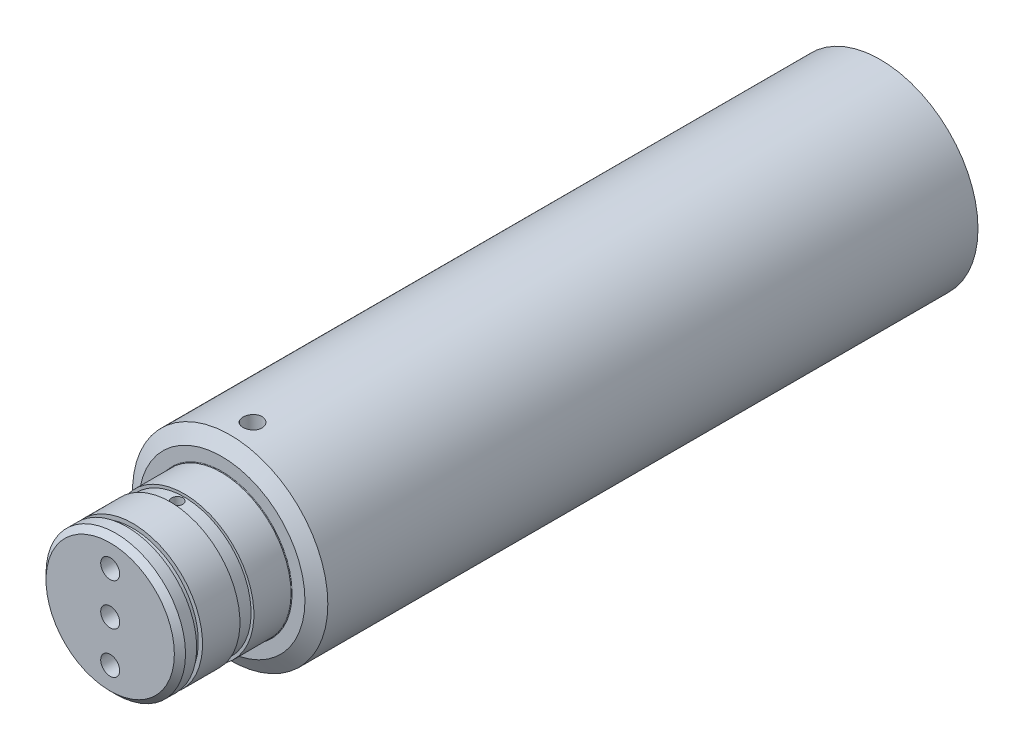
ISO-10303-21;
HEADER;
FILE_DESCRIPTION(('STEP AP214'),'2;1');
FILE_NAME('part.step','',(''),(''),'','','');
FILE_SCHEMA(('AUTOMOTIVE_DESIGN { 1 0 10303 214 1 1 1 1 }'));
ENDSEC;
DATA;
#1=APPLICATION_CONTEXT('core data for automotive mechanical design processes');
#2=APPLICATION_PROTOCOL_DEFINITION('international standard','automotive_design',2000,#1);
#3=PRODUCT_CONTEXT('',#1,'mechanical');
#4=PRODUCT('Part','Part','',(#3));
#5=PRODUCT_RELATED_PRODUCT_CATEGORY('part','',(#4));
#6=PRODUCT_DEFINITION_FORMATION('','',#4);
#7=PRODUCT_DEFINITION_CONTEXT('part definition',#1,'design');
#8=PRODUCT_DEFINITION('design','',#6,#7);
#9=PRODUCT_DEFINITION_SHAPE('','',#8);
#10=(LENGTH_UNIT() NAMED_UNIT(*) SI_UNIT(.MILLI.,.METRE.));
#11=(NAMED_UNIT(*) PLANE_ANGLE_UNIT() SI_UNIT($,.RADIAN.));
#12=(NAMED_UNIT(*) SI_UNIT($,.STERADIAN.) SOLID_ANGLE_UNIT());
#13=UNCERTAINTY_MEASURE_WITH_UNIT(LENGTH_MEASURE(1.E-05),#10,'distance_accuracy_value','');
#14=(GEOMETRIC_REPRESENTATION_CONTEXT(3) GLOBAL_UNCERTAINTY_ASSIGNED_CONTEXT((#13)) GLOBAL_UNIT_ASSIGNED_CONTEXT((#10,
#11,#12)) REPRESENTATION_CONTEXT('',''));
#15=CARTESIAN_POINT('',(0.,0.,0.));
#16=DIRECTION('',(0.,0.,1.));
#17=DIRECTION('',(1.,0.,0.));
#18=AXIS2_PLACEMENT_3D('',#15,#16,#17);
#19=CARTESIAN_POINT('',(0.,8.88178419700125E-13,187.852900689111));
#20=DIRECTION('',(0.,0.,-1.));
#21=DIRECTION('',(-1.00000000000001,0.,0.));
#22=AXIS2_PLACEMENT_3D('',#19,#20,#21);
#23=CYLINDRICAL_SURFACE('',#22,25.);
#24=CARTESIAN_POINT('',(0.,8.88178419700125E-13,270.000000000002));
#25=DIRECTION('',(0.,0.,-1.));
#26=DIRECTION('',(-1.00000000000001,0.,0.));
#27=AXIS2_PLACEMENT_3D('',#24,#25,#26);
#28=CIRCLE('',#27,25.);
#29=CARTESIAN_POINT('',(-25.0000000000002,8.64586180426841E-13,270.000000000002));
#30=VERTEX_POINT('',#29);
#31=EDGE_CURVE('E2052',#30,#30,#28,.T.);
#32=ORIENTED_EDGE('',*,*,#31,.F.);
#33=EDGE_LOOP('',(#32));
#34=FACE_BOUND('',#33,.T.);
#35=CARTESIAN_POINT('',(-2.22044604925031E-13,8.88178419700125E-13,274.000000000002));
#36=DIRECTION('',(0.,0.,1.));
#37=DIRECTION('',(1.00000000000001,0.,0.));
#38=AXIS2_PLACEMENT_3D('',#35,#36,#37);
#39=CIRCLE('',#38,25.);
#40=CARTESIAN_POINT('',(24.9999999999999,9.1177065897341E-13,274.000000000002));
#41=VERTEX_POINT('',#40);
#42=EDGE_CURVE('E2172',#41,#41,#39,.F.);
#43=ORIENTED_EDGE('',*,*,#42,.T.);
#44=EDGE_LOOP('',(#43));
#45=FACE_BOUND('',#44,.T.);
#46=ADVANCED_FACE('F2014',(#34,#45),#23,.T.);
#47=CARTESIAN_POINT('',(-4.44089209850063E-13,4.44089209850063E-13,236.000000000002));
#48=DIRECTION('',(0.,0.,-1.));
#49=DIRECTION('',(-1.00000000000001,0.,0.));
#50=AXIS2_PLACEMENT_3D('',#47,#48,#49);
#51=CYLINDRICAL_SURFACE('',#50,35.);
#52=CARTESIAN_POINT('',(1.33226762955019E-12,35.000000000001,228.400000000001));
#53=CARTESIAN_POINT('',(-0.19049784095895,34.9999978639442,228.399991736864));
#54=CARTESIAN_POINT('',(-0.381122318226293,34.9984282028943,228.383936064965));
#55=CARTESIAN_POINT('',(-0.757088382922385,34.992317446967,228.320128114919));
#56=CARTESIAN_POINT('',(-0.94242388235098,34.9877730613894,228.272340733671));
#57=CARTESIAN_POINT('',(-1.30231305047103,34.9762259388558,228.146471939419));
#58=CARTESIAN_POINT('',(-1.47687308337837,34.9692246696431,228.068408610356));
#59=CARTESIAN_POINT('',(-1.81037391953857,34.9535470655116,227.884238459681));
#60=CARTESIAN_POINT('',(-1.96931786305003,34.9448710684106,227.778137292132));
#61=CARTESIAN_POINT('',(-2.26765473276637,34.9267831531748,227.540515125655));
#62=CARTESIAN_POINT('',(-2.40698703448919,34.9173690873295,227.408918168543));
#63=CARTESIAN_POINT('',(-2.66162457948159,34.8988838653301,227.124201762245));
#64=CARTESIAN_POINT('',(-2.77692872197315,34.8898127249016,226.971081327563));
#65=CARTESIAN_POINT('',(-2.98045002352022,34.8730182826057,226.647287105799));
#66=CARTESIAN_POINT('',(-3.06861258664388,34.8652977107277,226.476578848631));
#67=CARTESIAN_POINT('',(-3.21499948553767,34.8521048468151,226.122693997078));
#68=CARTESIAN_POINT('',(-3.27322452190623,34.8466325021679,225.939517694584));
#69=CARTESIAN_POINT('',(-3.35790448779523,34.8385748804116,225.566512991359));
#70=CARTESIAN_POINT('',(-3.38445967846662,34.8359804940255,225.376707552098));
#71=CARTESIAN_POINT('',(-3.40535603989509,34.8339441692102,224.995317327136));
#72=CARTESIAN_POINT('',(-3.39969801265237,34.8345021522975,224.803732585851));
#73=CARTESIAN_POINT('',(-3.35641122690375,34.8386992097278,224.424912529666));
#74=CARTESIAN_POINT('',(-3.31889184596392,34.8423277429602,224.237664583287));
#75=CARTESIAN_POINT('',(-3.21311753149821,34.8522405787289,223.872136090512));
#76=CARTESIAN_POINT('',(-3.14486220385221,34.85852491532,223.693855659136));
#77=CARTESIAN_POINT('',(-2.97943246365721,34.8730534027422,223.350976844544));
#78=CARTESIAN_POINT('',(-2.88220942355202,34.8813008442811,223.186402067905));
#79=CARTESIAN_POINT('',(-2.66163902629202,34.8988234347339,222.875864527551));
#80=CARTESIAN_POINT('',(-2.53829094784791,34.9080986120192,222.729902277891));
#81=CARTESIAN_POINT('',(-2.26836049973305,34.9266785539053,222.460097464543));
#82=CARTESIAN_POINT('',(-2.12168365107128,34.9359832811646,222.336349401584));
#83=CARTESIAN_POINT('',(-1.80958763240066,34.9535374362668,222.115217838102));
#84=CARTESIAN_POINT('',(-1.64416844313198,34.9617868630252,222.01783436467));
#85=CARTESIAN_POINT('',(-1.29921865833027,34.9763034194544,221.852200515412));
#86=CARTESIAN_POINT('',(-1.11968580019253,34.9825702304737,221.783954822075));
#87=CARTESIAN_POINT('',(-0.751635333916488,34.9924121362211,221.67860246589));
#88=CARTESIAN_POINT('',(-0.563117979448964,34.995987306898,221.64149492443));
#89=CARTESIAN_POINT('',(-0.183268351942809,35.0000333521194,221.599591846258));
#90=CARTESIAN_POINT('',(0.00804940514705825,35.0005167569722,221.594665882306));
#91=CARTESIAN_POINT('',(0.388787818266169,34.9983583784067,221.616923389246));
#92=CARTESIAN_POINT('',(0.578208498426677,34.995716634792,221.644106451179));
#93=CARTESIAN_POINT('',(0.94940018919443,34.9876128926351,221.729702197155));
#94=CARTESIAN_POINT('',(1.13118538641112,34.9821563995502,221.788053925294));
#95=CARTESIAN_POINT('',(1.48238659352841,34.9690354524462,221.934268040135));
#96=CARTESIAN_POINT('',(1.65180234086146,34.9613709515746,222.022131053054));
#97=CARTESIAN_POINT('',(1.97404597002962,34.9446604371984,222.225197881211));
#98=CARTESIAN_POINT('',(2.12681954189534,34.9356101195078,222.34048752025));
#99=CARTESIAN_POINT('',(2.41089266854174,34.9171576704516,222.595011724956));
#100=CARTESIAN_POINT('',(2.54219171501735,34.9077555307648,222.734246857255));
#101=CARTESIAN_POINT('',(2.78004054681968,34.8896215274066,223.03327819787));
#102=CARTESIAN_POINT('',(2.88650482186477,34.8808920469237,223.193142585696));
#103=CARTESIAN_POINT('',(3.07107442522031,34.8651275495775,223.528557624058));
#104=CARTESIAN_POINT('',(3.14918012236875,34.8580925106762,223.704108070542));
#105=CARTESIAN_POINT('',(3.27467182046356,34.8465280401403,224.065616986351));
#106=CARTESIAN_POINT('',(3.32210896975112,34.8419944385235,224.251557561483));
#107=CARTESIAN_POINT('',(3.38508307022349,34.8359330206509,224.628810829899));
#108=CARTESIAN_POINT('',(3.40062088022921,34.834405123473,224.820123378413));
#109=CARTESIAN_POINT('',(3.39934369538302,34.834529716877,225.201840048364));
#110=CARTESIAN_POINT('',(3.38266303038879,34.8361690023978,225.392244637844));
#111=CARTESIAN_POINT('',(3.31770376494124,34.8424151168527,225.767533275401));
#112=CARTESIAN_POINT('',(3.26942512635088,34.8470219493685,225.952417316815));
#113=CARTESIAN_POINT('',(3.14267688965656,34.8586804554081,226.311417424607));
#114=CARTESIAN_POINT('',(3.06421096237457,34.8657318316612,226.485534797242));
#115=CARTESIAN_POINT('',(2.87932953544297,34.8814855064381,226.818148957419));
#116=CARTESIAN_POINT('',(2.77291424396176,34.8901877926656,226.976645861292));
#117=CARTESIAN_POINT('',(2.53465010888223,34.9083061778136,227.274208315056));
#118=CARTESIAN_POINT('',(2.40270124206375,34.9177249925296,227.413193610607));
#119=CARTESIAN_POINT('',(2.11731119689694,34.9361903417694,227.667110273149));
#120=CARTESIAN_POINT('',(1.96386486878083,34.9452367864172,227.782035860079));
#121=CARTESIAN_POINT('',(1.63943695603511,34.9619603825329,227.984784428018));
#122=CARTESIAN_POINT('',(1.46841425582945,34.9696342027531,228.072541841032));
#123=CARTESIAN_POINT('',(1.11409669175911,34.9827112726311,228.217977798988));
#124=CARTESIAN_POINT('',(0.930815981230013,34.9881170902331,228.275690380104));
#125=CARTESIAN_POINT('',(0.622074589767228,34.9946853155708,228.344950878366));
#126=CARTESIAN_POINT('',(0.498589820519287,34.9966690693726,228.365566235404));
#127=CARTESIAN_POINT('',(0.250088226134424,34.999327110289,228.393093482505));
#128=CARTESIAN_POINT('',(0.125071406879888,35.0000014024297,228.400005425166));
#129=CARTESIAN_POINT('',(1.33226762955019E-12,35.000000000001,228.400000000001));
#130=B_SPLINE_CURVE_WITH_KNOTS('',3,(#52,#53,#54,#55,#56,#57,#58,#59,#60,#61,#62,#63,#64,#65,
#66,#67,#68,#69,#70,#71,#72,#73,#74,#75,#76,#77,#78,#79,#80,#81,#82,#83,#84,#85,#86,#87,#88,#89,
#90,#91,#92,#93,#94,#95,#96,#97,#98,#99,#100,#101,#102,#103,#104,#105,#106,#107,#108,#109,#110,
#111,#112,#113,#114,#115,#116,#117,#118,#119,#120,#121,#122,#123,#124,#125,#126,#127,#128,#129),
.UNSPECIFIED.,.T.,.F.,(4,2,2,2,2,2,2,2,2,2,2,2,2,2,2,2,2,2,2,2,2,2,2,2,2,2,2,2,2,2,2,2,2,2,2,2,
2,2,4),(0.,0.571036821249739,1.14270640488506,1.71403505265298,2.2852485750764,2.8581908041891,
3.43115927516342,4.00527286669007,4.57937302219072,5.15165081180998,5.72391435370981,
6.29422126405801,6.86453548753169,7.43581253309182,8.00710535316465,8.58077369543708,
9.1544426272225,9.72820371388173,10.3019486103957,10.873366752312,11.4447776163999,
12.0150750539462,12.5853845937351,13.1575027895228,13.7296345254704,14.3037080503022,
14.8777741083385,15.4508802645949,16.0239709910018,16.5946774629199,17.165384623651,
17.7360224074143,18.3066559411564,18.8795718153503,19.4526251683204,20.0270509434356,
20.6008245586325,20.975740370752,21.3506547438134),.UNSPECIFIED.);
#131=CARTESIAN_POINT('',(1.33226762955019E-12,35.000000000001,228.400000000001));
#132=VERTEX_POINT('',#131);
#133=EDGE_CURVE('E2211',#132,#132,#130,.T.);
#134=ORIENTED_EDGE('',*,*,#133,.T.);
#135=EDGE_LOOP('',(#134));
#136=FACE_BOUND('',#135,.T.);
#137=CARTESIAN_POINT('',(-2.22044604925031E-13,8.88178419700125E-13,233.000000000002));
#138=DIRECTION('',(0.,0.,1.));
#139=DIRECTION('',(1.00000000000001,0.,0.));
#140=AXIS2_PLACEMENT_3D('',#137,#138,#139);
#141=CIRCLE('',#140,35.);
#142=CARTESIAN_POINT('',(35.,9.21207554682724E-13,233.000000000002));
#143=VERTEX_POINT('',#142);
#144=EDGE_CURVE('E2169',#143,#143,#141,.F.);
#145=ORIENTED_EDGE('',*,*,#144,.T.);
#146=EDGE_LOOP('',(#145));
#147=FACE_BOUND('',#146,.T.);
#148=CARTESIAN_POINT('',(0.,0.,0.));
#149=DIRECTION('',(0.,0.,1.));
#150=DIRECTION('',(1.00000000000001,0.,0.));
#151=AXIS2_PLACEMENT_3D('',#148,#149,#150);
#152=CIRCLE('',#151,35.);
#153=CARTESIAN_POINT('',(35.0000000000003,0.,0.));
#154=VERTEX_POINT('',#153);
#155=EDGE_CURVE('E2163',#154,#154,#152,.T.);
#156=ORIENTED_EDGE('',*,*,#155,.T.);
#157=EDGE_LOOP('',(#156));
#158=FACE_BOUND('',#157,.T.);
#159=ADVANCED_FACE('F2115',(#136,#147,#158),#51,.T.);
#160=CARTESIAN_POINT('',(-4.44089209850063E-13,4.44089209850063E-13,236.000000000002));
#161=DIRECTION('',(0.,0.,1.));
#162=DIRECTION('',(1.00000000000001,0.,0.));
#163=AXIS2_PLACEMENT_3D('',#160,#161,#162);
#164=PLANE('',#163);
#165=CARTESIAN_POINT('',(-4.44089209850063E-13,4.44089209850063E-13,236.000000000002));
#166=DIRECTION('',(0.,0.,1.));
#167=DIRECTION('',(1.00000000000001,0.,0.));
#168=AXIS2_PLACEMENT_3D('',#165,#166,#167);
#169=CIRCLE('',#168,25.2);
#170=CARTESIAN_POINT('',(25.1999999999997,4.67870187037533E-13,236.000000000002));
#171=VERTEX_POINT('',#170);
#172=EDGE_CURVE('E13',#171,#171,#169,.F.);
#173=ORIENTED_EDGE('',*,*,#172,.T.);
#174=EDGE_LOOP('',(#173));
#175=FACE_BOUND('',#174,.T.);
#176=CARTESIAN_POINT('',(-4.44089209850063E-13,4.44089209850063E-13,236.000000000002));
#177=DIRECTION('',(0.,0.,1.));
#178=DIRECTION('',(1.00000000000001,0.,0.));
#179=AXIS2_PLACEMENT_3D('',#176,#177,#178);
#180=CIRCLE('',#179,29.8038475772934);
#181=CARTESIAN_POINT('',(29.8038475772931,4.72214789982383E-13,236.000000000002));
#182=VERTEX_POINT('',#181);
#183=EDGE_CURVE('E2166',#182,#182,#180,.T.);
#184=ORIENTED_EDGE('',*,*,#183,.T.);
#185=EDGE_LOOP('',(#184));
#186=FACE_BOUND('',#185,.T.);
#187=ADVANCED_FACE('F2122',(#175,#186),#164,.T.);
#188=CARTESIAN_POINT('',(0.,0.,0.));
#189=DIRECTION('',(0.,0.,1.));
#190=DIRECTION('',(1.00000000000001,0.,0.));
#191=AXIS2_PLACEMENT_3D('',#188,#189,#190);
#192=PLANE('',#191);
#193=ORIENTED_EDGE('',*,*,#155,.F.);
#194=EDGE_LOOP('',(#193));
#195=FACE_BOUND('',#194,.T.);
#196=ADVANCED_FACE('F2203',(#195),#192,.F.);
#197=CARTESIAN_POINT('',(-4.44089209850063E-13,4.44089209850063E-13,236.000000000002));
#198=DIRECTION('',(0.,0.,-1.));
#199=DIRECTION('',(-1.00000000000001,0.,0.));
#200=AXIS2_PLACEMENT_3D('',#197,#198,#199);
#201=CONICAL_SURFACE('',#200,29.8038475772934,1.04719755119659);
#202=ORIENTED_EDGE('',*,*,#144,.F.);
#203=EDGE_LOOP('',(#202));
#204=FACE_BOUND('',#203,.T.);
#205=ORIENTED_EDGE('',*,*,#183,.F.);
#206=EDGE_LOOP('',(#205));
#207=FACE_BOUND('',#206,.T.);
#208=ADVANCED_FACE('F2188',(#204,#207),#201,.T.);
#209=CARTESIAN_POINT('',(0.,8.88178419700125E-13,187.852900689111));
#210=DIRECTION('',(0.,0.,-1.));
#211=DIRECTION('',(-1.00000000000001,0.,0.));
#212=AXIS2_PLACEMENT_3D('',#209,#210,#211);
#213=CYLINDRICAL_SURFACE('',#212,25.);
#214=CARTESIAN_POINT('',(-4.44089209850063E-13,4.44089209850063E-13,236.200000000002));
#215=DIRECTION('',(0.,0.,1.));
#216=DIRECTION('',(1.00000000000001,0.,0.));
#217=AXIS2_PLACEMENT_3D('',#214,#215,#216);
#218=CIRCLE('',#217,25.);
#219=CARTESIAN_POINT('',(24.9999999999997,4.67681449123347E-13,236.200000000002));
#220=VERTEX_POINT('',#219);
#221=EDGE_CURVE('E2022',#220,#220,#218,.T.);
#222=ORIENTED_EDGE('',*,*,#221,.T.);
#223=EDGE_LOOP('',(#222));
#224=FACE_BOUND('',#223,.T.);
#225=CARTESIAN_POINT('',(4.44089209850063E-13,1.33226762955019E-12,249.500000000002));
#226=DIRECTION('',(0.,0.,-1.));
#227=DIRECTION('',(-1.00000000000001,0.,0.));
#228=AXIS2_PLACEMENT_3D('',#225,#226,#227);
#229=CIRCLE('',#228,25.);
#230=CARTESIAN_POINT('',(-24.9999999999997,1.3086753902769E-12,249.500000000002));
#231=VERTEX_POINT('',#230);
#232=EDGE_CURVE('E2160',#231,#231,#229,.T.);
#233=ORIENTED_EDGE('',*,*,#232,.T.);
#234=EDGE_LOOP('',(#233));
#235=FACE_BOUND('',#234,.T.);
#236=ADVANCED_FACE('F2183',(#224,#235),#213,.T.);
#237=CARTESIAN_POINT('',(7.7715611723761E-13,24.9999999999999,249.500000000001));
#238=DIRECTION('',(0.,0.,1.));
#239=DIRECTION('',(1.00000000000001,0.,0.));
#240=AXIS2_PLACEMENT_3D('',#237,#238,#239);
#241=PLANE('',#240);
#242=CARTESIAN_POINT('',(4.44089209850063E-13,1.33226762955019E-12,249.500000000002));
#243=DIRECTION('',(0.,0.,-1.));
#244=DIRECTION('',(-1.00000000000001,0.,0.));
#245=AXIS2_PLACEMENT_3D('',#242,#243,#244);
#246=CIRCLE('',#245,24.);
#247=CARTESIAN_POINT('',(-23.9999999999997,1.30961907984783E-12,249.500000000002));
#248=VERTEX_POINT('',#247);
#249=EDGE_CURVE('E2151',#248,#248,#246,.T.);
#250=ORIENTED_EDGE('',*,*,#249,.T.);
#251=EDGE_LOOP('',(#250));
#252=FACE_BOUND('',#251,.T.);
#253=ORIENTED_EDGE('',*,*,#232,.F.);
#254=EDGE_LOOP('',(#253));
#255=FACE_BOUND('',#254,.T.);
#256=ADVANCED_FACE('F2187',(#252,#255),#241,.T.);
#257=CARTESIAN_POINT('',(0.,8.88178419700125E-13,187.852900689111));
#258=DIRECTION('',(0.,0.,-1.));
#259=DIRECTION('',(-1.00000000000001,0.,0.));
#260=AXIS2_PLACEMENT_3D('',#257,#258,#259);
#261=CYLINDRICAL_SURFACE('',#260,24.);
#262=CARTESIAN_POINT('',(-4.44089209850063E-13,23.9999999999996,254.000000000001));
#263=CARTESIAN_POINT('',(0.112132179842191,23.9999989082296,253.999995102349));
#264=CARTESIAN_POINT('',(0.224340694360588,23.9992057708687,253.99053806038));
#265=CARTESIAN_POINT('',(0.44565314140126,23.9961180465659,253.952951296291));
#266=CARTESIAN_POINT('',(0.55475341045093,23.9938217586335,253.92480041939));
#267=CARTESIAN_POINT('',(0.766612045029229,23.9879872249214,253.850645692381));
#268=CARTESIAN_POINT('',(0.869373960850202,23.98444968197,253.804651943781));
#269=CARTESIAN_POINT('',(1.06569446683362,23.9765293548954,253.696135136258));
#270=CARTESIAN_POINT('',(1.15925501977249,23.9721467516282,253.633615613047));
#271=CARTESIAN_POINT('',(1.33477999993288,23.9630155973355,253.49364986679));
#272=CARTESIAN_POINT('',(1.41671774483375,23.9582662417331,253.416170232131));
#273=CARTESIAN_POINT('',(1.56644226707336,23.9489436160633,253.248554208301));
#274=CARTESIAN_POINT('',(1.63422842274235,23.9443703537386,253.158417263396));
#275=CARTESIAN_POINT('',(1.75381584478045,23.9359090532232,252.967883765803));
#276=CARTESIAN_POINT('',(1.80559366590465,23.9320220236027,252.867472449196));
#277=CARTESIAN_POINT('',(1.8915448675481,23.925382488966,252.65934340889));
#278=CARTESIAN_POINT('',(1.9257185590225,23.9226299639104,252.551625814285));
#279=CARTESIAN_POINT('',(1.97541405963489,23.9185778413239,252.332209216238));
#280=CARTESIAN_POINT('',(1.99097933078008,23.9172748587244,252.220520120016));
#281=CARTESIAN_POINT('',(2.00315041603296,23.9162586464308,251.996107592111));
#282=CARTESIAN_POINT('',(1.99975658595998,23.9165453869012,251.883384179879));
#283=CARTESIAN_POINT('',(1.97414172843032,23.9186731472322,251.66040066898));
#284=CARTESIAN_POINT('',(1.95196793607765,23.9205102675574,251.550135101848));
#285=CARTESIAN_POINT('',(1.88949597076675,23.9255256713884,251.334896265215));
#286=CARTESIAN_POINT('',(1.84919762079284,23.928703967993,251.229923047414));
#287=CARTESIAN_POINT('',(1.75156757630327,23.936048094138,251.028098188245));
#288=CARTESIAN_POINT('',(1.69421468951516,23.9402151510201,250.931256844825));
#289=CARTESIAN_POINT('',(1.56411888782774,23.9490661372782,250.748557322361));
#290=CARTESIAN_POINT('',(1.49137566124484,23.9537500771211,250.662699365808));
#291=CARTESIAN_POINT('',(1.33229916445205,23.9631244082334,250.504129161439));
#292=CARTESIAN_POINT('',(1.2459250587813,23.967814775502,250.431457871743));
#293=CARTESIAN_POINT('',(1.06218111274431,23.9766598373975,250.301640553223));
#294=CARTESIAN_POINT('',(0.964811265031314,23.9808145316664,250.244494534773));
#295=CARTESIAN_POINT('',(0.761813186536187,23.9881209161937,250.147352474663));
#296=CARTESIAN_POINT('',(0.656184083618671,23.9912725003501,250.107358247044));
#297=CARTESIAN_POINT('',(0.439678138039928,23.9962163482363,250.045683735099));
#298=CARTESIAN_POINT('',(0.328801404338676,23.9980086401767,250.024003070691));
#299=CARTESIAN_POINT('',(0.105302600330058,24.0000283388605,249.999622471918));
#300=CARTESIAN_POINT('',(-0.00731325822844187,24.0002604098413,249.996865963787));
#301=CARTESIAN_POINT('',(-0.231405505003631,23.9991459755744,250.010263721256));
#302=CARTESIAN_POINT('',(-0.34288190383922,23.9977994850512,250.026417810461));
#303=CARTESIAN_POINT('',(-0.561369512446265,23.9936823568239,250.077131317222));
#304=CARTESIAN_POINT('',(-0.668386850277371,23.9909137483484,250.111664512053));
#305=CARTESIAN_POINT('',(-0.875108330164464,23.9842634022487,250.198129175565));
#306=CARTESIAN_POINT('',(-0.974812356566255,23.9803816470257,250.250060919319));
#307=CARTESIAN_POINT('',(-1.16433443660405,23.9719285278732,250.369990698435));
#308=CARTESIAN_POINT('',(-1.25412870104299,23.9673555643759,250.438026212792));
#309=CARTESIAN_POINT('',(-1.42104218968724,23.9580391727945,250.588178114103));
#310=CARTESIAN_POINT('',(-1.4981611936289,23.9532957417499,250.670294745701));
#311=CARTESIAN_POINT('',(-1.63772909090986,23.9441592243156,250.846523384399));
#312=CARTESIAN_POINT('',(-1.70014106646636,23.9397670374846,250.940664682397));
#313=CARTESIAN_POINT('',(-1.80827012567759,23.9318430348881,251.138124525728));
#314=CARTESIAN_POINT('',(-1.85398737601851,23.9283112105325,251.24144297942));
#315=CARTESIAN_POINT('',(-1.92736635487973,23.9225128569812,251.454193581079));
#316=CARTESIAN_POINT('',(-1.9550506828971,23.9202447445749,251.563617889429));
#317=CARTESIAN_POINT('',(-1.99165153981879,23.9172253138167,251.785581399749));
#318=CARTESIAN_POINT('',(-2.00056842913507,23.9164739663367,251.898120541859));
#319=CARTESIAN_POINT('',(-1.99937712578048,23.9165735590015,252.122752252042));
#320=CARTESIAN_POINT('',(-1.98932693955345,23.9174196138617,252.234845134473));
#321=CARTESIAN_POINT('',(-1.95060772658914,23.9206083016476,252.455745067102));
#322=CARTESIAN_POINT('',(-1.9219386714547,23.922950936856,252.564552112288));
#323=CARTESIAN_POINT('',(-1.84681022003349,23.9288675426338,252.775795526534));
#324=CARTESIAN_POINT('',(-1.80035186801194,23.9324414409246,252.878232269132));
#325=CARTESIAN_POINT('',(-1.69097011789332,23.9404179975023,253.073861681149));
#326=CARTESIAN_POINT('',(-1.62804697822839,23.9448206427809,253.167054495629));
#327=CARTESIAN_POINT('',(-1.48730388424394,23.9539746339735,253.341847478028));
#328=CARTESIAN_POINT('',(-1.4094409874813,23.9587269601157,253.423413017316));
#329=CARTESIAN_POINT('',(-1.24110645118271,23.9680359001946,253.572350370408));
#330=CARTESIAN_POINT('',(-1.15063176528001,23.9725924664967,253.639718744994));
#331=CARTESIAN_POINT('',(-0.959467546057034,23.9810046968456,253.758439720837));
#332=CARTESIAN_POINT('',(-0.858759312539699,23.984859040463,253.809762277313));
#333=CARTESIAN_POINT('',(-0.650191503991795,23.9914170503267,253.894703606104));
#334=CARTESIAN_POINT('',(-0.542340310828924,23.994122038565,253.928342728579));
#335=CARTESIAN_POINT('',(-0.361544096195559,23.9973821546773,253.968395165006));
#336=CARTESIAN_POINT('',(-0.289761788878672,23.99835937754,253.980231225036));
#337=CARTESIAN_POINT('',(-0.145330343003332,23.9996686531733,253.996035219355));
#338=CARTESIAN_POINT('',(-0.0726812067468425,24.0000007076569,254.000003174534));
#339=CARTESIAN_POINT('',(-4.44089209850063E-13,23.9999999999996,254.000000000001));
#340=B_SPLINE_CURVE_WITH_KNOTS('',3,(#262,#263,#264,#265,#266,#267,#268,#269,#270,#271,#272,
#273,#274,#275,#276,#277,#278,#279,#280,#281,#282,#283,#284,#285,#286,#287,#288,#289,#290,#291,
#292,#293,#294,#295,#296,#297,#298,#299,#300,#301,#302,#303,#304,#305,#306,#307,#308,#309,#310,
#311,#312,#313,#314,#315,#316,#317,#318,#319,#320,#321,#322,#323,#324,#325,#326,#327,#328,#329,
#330,#331,#332,#333,#334,#335,#336,#337,#338,#339),.UNSPECIFIED.,.T.,.F.,(4,2,2,2,2,2,2,2,2,2,2,
2,2,2,2,2,2,2,2,2,2,2,2,2,2,2,2,2,2,2,2,2,2,2,2,2,2,2,4),(0.,0.336131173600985,
0.672643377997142,1.00896534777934,1.34521541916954,1.68222533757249,2.0192500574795,
2.35676605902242,2.69427609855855,3.03099629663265,3.36771017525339,3.70357966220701,
4.0394524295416,4.37574431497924,4.712043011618,5.04936901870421,5.38669525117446,
5.72405715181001,6.06141205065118,6.39775798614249,6.73410078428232,7.06996498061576,
7.40583448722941,7.74249349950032,8.07915836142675,8.41665952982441,8.75415732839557,
9.0912313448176,9.42829888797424,9.76433725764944,10.1003761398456,10.4363952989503,
10.7724091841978,11.1094037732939,11.4464799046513,11.7841834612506,12.1214975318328,
12.3393697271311,12.5572413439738),.UNSPECIFIED.);
#341=CARTESIAN_POINT('',(-4.44089209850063E-13,23.9999999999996,254.000000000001));
#342=VERTEX_POINT('',#341);
#343=EDGE_CURVE('E2074',#342,#342,#340,.T.);
#344=ORIENTED_EDGE('',*,*,#343,.F.);
#345=EDGE_LOOP('',(#344));
#346=FACE_BOUND('',#345,.T.);
#347=CARTESIAN_POINT('',(-2.22044604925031E-13,8.88178419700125E-13,254.500000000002));
#348=DIRECTION('',(0.,0.,-1.));
#349=DIRECTION('',(-1.00000000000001,0.,0.));
#350=AXIS2_PLACEMENT_3D('',#347,#348,#349);
#351=CIRCLE('',#350,24.);
#352=CARTESIAN_POINT('',(-24.0000000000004,8.65529869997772E-13,254.500000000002));
#353=VERTEX_POINT('',#352);
#354=EDGE_CURVE('E2147',#353,#353,#351,.T.);
#355=ORIENTED_EDGE('',*,*,#354,.T.);
#356=EDGE_LOOP('',(#355));
#357=FACE_BOUND('',#356,.T.);
#358=ORIENTED_EDGE('',*,*,#249,.F.);
#359=EDGE_LOOP('',(#358));
#360=FACE_BOUND('',#359,.T.);
#361=ADVANCED_FACE('F2139',(#346,#357,#360),#261,.T.);
#362=CARTESIAN_POINT('',(-7.7715611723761E-13,23.9999999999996,254.500000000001));
#363=DIRECTION('',(0.,0.,-1.));
#364=DIRECTION('',(-1.00000000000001,0.,0.));
#365=AXIS2_PLACEMENT_3D('',#362,#363,#364);
#366=PLANE('',#365);
#367=CARTESIAN_POINT('',(-2.22044604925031E-13,8.88178419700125E-13,254.500000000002));
#368=DIRECTION('',(0.,0.,-1.));
#369=DIRECTION('',(-1.00000000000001,0.,0.));
#370=AXIS2_PLACEMENT_3D('',#367,#368,#369);
#371=CIRCLE('',#370,25.);
#372=CARTESIAN_POINT('',(-25.0000000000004,8.64586180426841E-13,254.500000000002));
#373=VERTEX_POINT('',#372);
#374=EDGE_CURVE('E2146',#373,#373,#371,.T.);
#375=ORIENTED_EDGE('',*,*,#374,.T.);
#376=EDGE_LOOP('',(#375));
#377=FACE_BOUND('',#376,.T.);
#378=ORIENTED_EDGE('',*,*,#354,.F.);
#379=EDGE_LOOP('',(#378));
#380=FACE_BOUND('',#379,.T.);
#381=ADVANCED_FACE('F2131',(#377,#380),#366,.T.);
#382=CARTESIAN_POINT('',(3.10862446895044E-12,1.33226762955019E-12,267.900000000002));
#383=DIRECTION('',(0.,0.,-1.));
#384=DIRECTION('',(-1.00000000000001,0.,0.));
#385=AXIS2_PLACEMENT_3D('',#382,#383,#384);
#386=CIRCLE('',#385,25.);
#387=CARTESIAN_POINT('',(-24.9999999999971,1.3086753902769E-12,267.900000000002));
#388=VERTEX_POINT('',#387);
#389=EDGE_CURVE('E2143',#388,#388,#386,.T.);
#390=ORIENTED_EDGE('',*,*,#389,.T.);
#391=EDGE_LOOP('',(#390));
#392=FACE_BOUND('',#391,.T.);
#393=ORIENTED_EDGE('',*,*,#374,.F.);
#394=EDGE_LOOP('',(#393));
#395=FACE_BOUND('',#394,.T.);
#396=ADVANCED_FACE('F2118',(#392,#395),#23,.T.);
#397=CARTESIAN_POINT('',(5.55111512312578E-13,24.9999999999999,276.));
#398=DIRECTION('',(0.,0.,1.));
#399=DIRECTION('',(1.00000000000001,0.,0.));
#400=AXIS2_PLACEMENT_3D('',#397,#398,#399);
#401=PLANE('',#400);
#402=CARTESIAN_POINT('',(-1.55431223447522E-12,14.9999999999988,276.));
#403=DIRECTION('',(0.,0.,1.));
#404=DIRECTION('',(1.00000000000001,0.,0.));
#405=AXIS2_PLACEMENT_3D('',#402,#403,#404);
#406=CIRCLE('',#405,3.39999999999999);
#407=CARTESIAN_POINT('',(3.39999999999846,14.9999999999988,276.));
#408=VERTEX_POINT('',#407);
#409=EDGE_CURVE('E2051',#408,#408,#406,.T.);
#410=ORIENTED_EDGE('',*,*,#409,.F.);
#411=EDGE_LOOP('',(#410));
#412=FACE_BOUND('',#411,.T.);
#413=CARTESIAN_POINT('',(6.66133814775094E-13,-15.0000000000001,276.000000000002));
#414=DIRECTION('',(0.,0.,1.));
#415=DIRECTION('',(1.00000000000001,0.,0.));
#416=AXIS2_PLACEMENT_3D('',#413,#414,#415);
#417=CIRCLE('',#416,3.39999999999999);
#418=CARTESIAN_POINT('',(3.40000000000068,-15.0000000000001,276.000000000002));
#419=VERTEX_POINT('',#418);
#420=EDGE_CURVE('E2064',#419,#419,#417,.T.);
#421=ORIENTED_EDGE('',*,*,#420,.F.);
#422=EDGE_LOOP('',(#421));
#423=FACE_BOUND('',#422,.T.);
#424=CARTESIAN_POINT('',(-3.33066907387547E-13,8.88178419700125E-13,276.000000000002));
#425=DIRECTION('',(0.,0.,1.));
#426=DIRECTION('',(1.00000000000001,0.,0.));
#427=AXIS2_PLACEMENT_3D('',#424,#425,#426);
#428=CIRCLE('',#427,3.39999999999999);
#429=CARTESIAN_POINT('',(3.39999999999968,8.91386964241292E-13,276.000000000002));
#430=VERTEX_POINT('',#429);
#431=EDGE_CURVE('E2148',#430,#430,#428,.T.);
#432=ORIENTED_EDGE('',*,*,#431,.F.);
#433=EDGE_LOOP('',(#432));
#434=FACE_BOUND('',#433,.T.);
#435=CARTESIAN_POINT('',(-3.33066907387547E-13,8.88178419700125E-13,276.000000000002));
#436=DIRECTION('',(0.,0.,1.));
#437=DIRECTION('',(1.00000000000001,0.,0.));
#438=AXIS2_PLACEMENT_3D('',#435,#436,#437);
#439=CIRCLE('',#438,23.);
#440=CARTESIAN_POINT('',(22.9999999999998,9.09883279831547E-13,276.000000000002));
#441=VERTEX_POINT('',#440);
#442=EDGE_CURVE('E2175',#441,#441,#439,.T.);
#443=ORIENTED_EDGE('',*,*,#442,.T.);
#444=EDGE_LOOP('',(#443));
#445=FACE_BOUND('',#444,.T.);
#446=ADVANCED_FACE('F2130',(#412,#423,#434,#445),#401,.T.);
#447=CARTESIAN_POINT('',(-2.22044604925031E-13,8.88178419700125E-13,274.000000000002));
#448=DIRECTION('',(0.,0.,-1.));
#449=DIRECTION('',(-1.00000000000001,0.,0.));
#450=AXIS2_PLACEMENT_3D('',#447,#448,#449);
#451=CONICAL_SURFACE('',#450,25.,0.785398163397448);
#452=ORIENTED_EDGE('',*,*,#442,.F.);
#453=EDGE_LOOP('',(#452));
#454=FACE_BOUND('',#453,.T.);
#455=ORIENTED_EDGE('',*,*,#42,.F.);
#456=EDGE_LOOP('',(#455));
#457=FACE_BOUND('',#456,.T.);
#458=ADVANCED_FACE('F2137',(#454,#457),#451,.T.);
#459=CARTESIAN_POINT('',(-3.33066907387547E-13,8.88178419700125E-13,276.000000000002));
#460=DIRECTION('',(0.,0.,1.));
#461=DIRECTION('',(1.00000000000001,0.,0.));
#462=AXIS2_PLACEMENT_3D('',#459,#460,#461);
#463=CYLINDRICAL_SURFACE('',#462,3.39999999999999);
#464=CARTESIAN_POINT('',(2.66453525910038E-12,3.4000000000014,254.000000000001));
#465=CARTESIAN_POINT('',(0.102624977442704,3.39999563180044,253.999995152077));
#466=CARTESIAN_POINT('',(0.205435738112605,3.39530186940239,253.992044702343));
#467=CARTESIAN_POINT('',(0.407989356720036,3.37697322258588,253.960639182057));
#468=CARTESIAN_POINT('',(0.50772315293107,3.36331416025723,253.93714218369));
#469=CARTESIAN_POINT('',(0.700745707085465,3.32844220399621,253.87594098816));
#470=CARTESIAN_POINT('',(0.794063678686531,3.30726669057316,253.838307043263));
#471=CARTESIAN_POINT('',(0.972779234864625,3.25918334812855,253.75032307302));
#472=CARTESIAN_POINT('',(1.05817929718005,3.23227732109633,253.699977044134));
#473=CARTESIAN_POINT('',(1.22586972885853,3.17265522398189,253.583797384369));
#474=CARTESIAN_POINT('',(1.30744987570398,3.13965512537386,253.517087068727));
#475=CARTESIAN_POINT('',(1.4589576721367,3.07218754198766,253.372028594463));
#476=CARTESIAN_POINT('',(1.52887050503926,3.03771826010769,253.293665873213));
#477=CARTESIAN_POINT('',(1.66332636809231,2.96644259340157,253.11673461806));
#478=CARTESIAN_POINT('',(1.72628901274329,2.9298333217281,253.016875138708));
#479=CARTESIAN_POINT('',(1.83428568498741,2.86346519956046,252.805844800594));
#480=CARTESIAN_POINT('',(1.87934811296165,2.83369552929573,252.694692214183));
#481=CARTESIAN_POINT('',(1.94107416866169,2.79164600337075,252.490703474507));
#482=CARTESIAN_POINT('',(1.96190925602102,2.7769067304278,252.399638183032));
#483=CARTESIAN_POINT('',(1.99065727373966,2.75637600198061,252.214542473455));
#484=CARTESIAN_POINT('',(1.99858531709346,2.75057408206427,252.120515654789));
#485=CARTESIAN_POINT('',(2.00106954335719,2.74876778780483,251.932029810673));
#486=CARTESIAN_POINT('',(1.99560302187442,2.75278004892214,251.837570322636));
#487=CARTESIAN_POINT('',(1.97158941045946,2.77002577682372,251.651172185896));
#488=CARTESIAN_POINT('',(1.9530328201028,2.7832659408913,251.559235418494));
#489=CARTESIAN_POINT('',(1.90401884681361,2.81701554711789,251.380975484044));
#490=CARTESIAN_POINT('',(1.87366899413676,2.83745915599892,251.294609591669));
#491=CARTESIAN_POINT('',(1.80215508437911,2.88340767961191,251.127950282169));
#492=CARTESIAN_POINT('',(1.7609869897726,2.90891448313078,251.04765914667));
#493=CARTESIAN_POINT('',(1.66098215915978,2.96732632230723,250.881023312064));
#494=CARTESIAN_POINT('',(1.6003355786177,3.00075327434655,250.795946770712));
#495=CARTESIAN_POINT('',(1.46670878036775,3.06828609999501,250.636322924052));
#496=CARTESIAN_POINT('',(1.39371727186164,3.1023925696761,250.561785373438));
#497=CARTESIAN_POINT('',(1.22629399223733,3.17261005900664,250.415679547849));
#498=CARTESIAN_POINT('',(1.13031267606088,3.2084161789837,250.345721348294));
#499=CARTESIAN_POINT('',(0.925766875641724,3.27329169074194,250.223165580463));
#500=CARTESIAN_POINT('',(0.817209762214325,3.30236499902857,250.170557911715));
#501=CARTESIAN_POINT('',(0.597859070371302,3.3487732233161,250.088099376));
#502=CARTESIAN_POINT('',(0.487686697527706,3.36675657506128,250.056975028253));
#503=CARTESIAN_POINT('',(0.262474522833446,3.3917386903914,250.013997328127));
#504=CARTESIAN_POINT('',(0.147440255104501,3.39874961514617,250.002122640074));
#505=CARTESIAN_POINT('',(-0.0680320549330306,3.40080244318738,249.998638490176));
#506=CARTESIAN_POINT('',(-0.168426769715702,3.39727968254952,250.004598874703));
#507=CARTESIAN_POINT('',(-0.366524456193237,3.38164554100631,250.031334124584));
#508=CARTESIAN_POINT('',(-0.464227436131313,3.36953418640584,250.052108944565));
#509=CARTESIAN_POINT('',(-0.652577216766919,3.33812933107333,250.106960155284));
#510=CARTESIAN_POINT('',(-0.7433199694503,3.31897032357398,250.140788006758));
#511=CARTESIAN_POINT('',(-0.917856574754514,3.27500362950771,250.22046323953));
#512=CARTESIAN_POINT('',(-1.00164893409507,3.25019473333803,250.266313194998));
#513=CARTESIAN_POINT('',(-1.16933565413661,3.19394232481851,250.37408503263));
#514=CARTESIAN_POINT('',(-1.25233009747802,3.1620767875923,250.437184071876));
#515=CARTESIAN_POINT('',(-1.40719177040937,3.0962731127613,250.575016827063));
#516=CARTESIAN_POINT('',(-1.47904583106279,3.06233258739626,250.649764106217));
#517=CARTESIAN_POINT('',(-1.61862869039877,2.99113687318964,250.819509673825));
#518=CARTESIAN_POINT('',(-1.68476854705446,2.95398618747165,250.915867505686));
#519=CARTESIAN_POINT('',(-1.79987765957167,2.88529808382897,251.120146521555));
#520=CARTESIAN_POINT('',(-1.84886727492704,2.8537540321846,251.228053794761));
#521=CARTESIAN_POINT('',(-1.91898299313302,2.80693530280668,251.428827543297));
#522=CARTESIAN_POINT('',(-1.94384155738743,2.78961831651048,251.519910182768));
#523=CARTESIAN_POINT('',(-1.98050807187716,2.76371221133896,251.705828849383));
#524=CARTESIAN_POINT('',(-1.99233281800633,2.7551118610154,251.800659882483));
#525=CARTESIAN_POINT('',(-2.0022752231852,2.74789700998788,251.991718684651));
#526=CARTESIAN_POINT('',(-2.00035201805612,2.74931227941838,252.087949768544));
#527=CARTESIAN_POINT('',(-1.98282528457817,2.76197600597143,252.278517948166));
#528=CARTESIAN_POINT('',(-1.96721361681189,2.77323031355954,252.37285388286));
#529=CARTESIAN_POINT('',(-1.92396602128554,2.80339258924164,252.553823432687));
#530=CARTESIAN_POINT('',(-1.89676576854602,2.82202165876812,252.640610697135));
#531=CARTESIAN_POINT('',(-1.83150638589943,2.86480405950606,252.808522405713));
#532=CARTESIAN_POINT('',(-1.79344317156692,2.88895946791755,252.889644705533));
#533=CARTESIAN_POINT('',(-1.70075199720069,2.94462074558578,253.057350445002));
#534=CARTESIAN_POINT('',(-1.64447161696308,2.97668562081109,253.142834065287));
#535=CARTESIAN_POINT('',(-1.5198751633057,3.04219379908,253.303982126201));
#536=CARTESIAN_POINT('',(-1.45154946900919,3.07563818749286,253.379638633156));
#537=CARTESIAN_POINT('',(-1.29293437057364,3.14593273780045,253.530349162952));
#538=CARTESIAN_POINT('',(-1.20089294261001,3.1825615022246,253.603682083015));
#539=CARTESIAN_POINT('',(-1.00383701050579,3.25010247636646,253.733856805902));
#540=CARTESIAN_POINT('',(-0.898819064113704,3.28101316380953,253.790694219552));
#541=CARTESIAN_POINT('',(-0.682920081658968,3.33246778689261,253.883286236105));
#542=CARTESIAN_POINT('',(-0.572483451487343,3.35339936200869,253.919840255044));
#543=CARTESIAN_POINT('',(-0.402565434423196,3.37657100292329,253.959933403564));
#544=CARTESIAN_POINT('',(-0.345280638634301,3.38292145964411,253.970837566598));
#545=CARTESIAN_POINT('',(-0.2297499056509,3.39272167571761,253.98761413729));
#546=CARTESIAN_POINT('',(-0.171504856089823,3.3961739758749,253.993490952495));
#547=CARTESIAN_POINT('',(-0.0942699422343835,3.39874524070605,253.997866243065));
#548=CARTESIAN_POINT('',(-0.075428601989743,3.39921533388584,253.998665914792));
#549=CARTESIAN_POINT('',(-0.0377269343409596,3.39984311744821,253.99973324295));
#550=CARTESIAN_POINT('',(-0.0188666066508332,3.40000080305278,254.000000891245));
#551=CARTESIAN_POINT('',(2.66453525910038E-12,3.4000000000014,254.000000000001));
#552=B_SPLINE_CURVE_WITH_KNOTS('',3,(#464,#465,#466,#467,#468,#469,#470,#471,#472,#473,#474,
#475,#476,#477,#478,#479,#480,#481,#482,#483,#484,#485,#486,#487,#488,#489,#490,#491,#492,#493,
#494,#495,#496,#497,#498,#499,#500,#501,#502,#503,#504,#505,#506,#507,#508,#509,#510,#511,#512,
#513,#514,#515,#516,#517,#518,#519,#520,#521,#522,#523,#524,#525,#526,#527,#528,#529,#530,#531,
#532,#533,#534,#535,#536,#537,#538,#539,#540,#541,#542,#543,#544,#545,#546,#547,#548,#549,#550,
#551),.UNSPECIFIED.,.T.,.F.,(4,2,2,2,2,2,2,2,2,2,2,2,2,2,2,2,2,2,2,2,2,2,2,2,2,2,2,2,2,2,2,2,2,
2,2,2,2,2,2,2,2,2,2,4),(0.,0.307797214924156,0.616427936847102,0.92354481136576,
1.23056525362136,1.56054697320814,1.89094460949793,2.2599239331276,2.62831547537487,
2.91082528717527,3.19300406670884,3.47566148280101,3.75852425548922,4.0388662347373,
4.31931299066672,4.64712883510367,4.97524614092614,5.34549300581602,5.71552395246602,
6.06111668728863,6.4063261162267,6.70673153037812,7.00713602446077,7.30208236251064,
7.59709190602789,7.92285433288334,8.24899895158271,8.61517633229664,8.98091752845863,
9.26768033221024,9.55407316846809,9.84131762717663,10.1287330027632,10.4061830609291,
10.6837375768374,11.0042754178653,11.3250704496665,11.6929897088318,12.06100677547,
12.4132457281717,12.5889807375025,12.7645615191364,12.8211461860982,12.8777317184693),.UNSPECIFIED.);
#553=CARTESIAN_POINT('',(2.66453525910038E-12,3.4000000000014,254.000000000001));
#554=VERTEX_POINT('',#553);
#555=EDGE_CURVE('E2067',#554,#554,#552,.T.);
#556=ORIENTED_EDGE('',*,*,#555,.T.);
#557=EDGE_LOOP('',(#556));
#558=FACE_BOUND('',#557,.T.);
#559=CARTESIAN_POINT('',(-4.44089209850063E-13,4.44089209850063E-13,225.000000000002));
#560=DIRECTION('',(0.,-0.707106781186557,0.707106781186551));
#561=DIRECTION('',(0.,0.707106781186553,0.707106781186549));
#562=AXIS2_PLACEMENT_3D('',#559,#560,#561);
#563=ELLIPSE('',#562,4.80832611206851,3.39999999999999);
#564=CARTESIAN_POINT('',(-3.40000000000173,-1.33226762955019E-12,225.000000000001));
#565=VERTEX_POINT('',#564);
#566=CARTESIAN_POINT('',(3.40000000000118,-1.33226762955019E-12,225.000000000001));
#567=VERTEX_POINT('',#566);
#568=EDGE_CURVE('E2178',#565,#567,#563,.F.);
#569=ORIENTED_EDGE('',*,*,#568,.T.);
#570=CARTESIAN_POINT('',(-4.44089209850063E-13,4.44089209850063E-13,225.000000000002));
#571=DIRECTION('',(0.,0.707106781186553,0.707106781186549));
#572=DIRECTION('',(0.,-0.707106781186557,0.707106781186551));
#573=AXIS2_PLACEMENT_3D('',#570,#571,#572);
#574=ELLIPSE('',#573,4.80832611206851,3.39999999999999);
#575=EDGE_CURVE('E2028',#567,#565,#574,.T.);
#576=ORIENTED_EDGE('',*,*,#575,.T.);
#577=EDGE_LOOP('',(#569,#576));
#578=FACE_BOUND('',#577,.T.);
#579=CARTESIAN_POINT('',(-1.11022302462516E-13,8.88178419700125E-13,221.000000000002));
#580=DIRECTION('',(0.,0.,1.));
#581=DIRECTION('',(1.00000000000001,0.,0.));
#582=AXIS2_PLACEMENT_3D('',#579,#580,#581);
#583=CIRCLE('',#582,3.39999999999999);
#584=CARTESIAN_POINT('',(3.3999999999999,8.91386964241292E-13,221.000000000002));
#585=VERTEX_POINT('',#584);
#586=EDGE_CURVE('E2154',#585,#585,#583,.T.);
#587=ORIENTED_EDGE('',*,*,#586,.F.);
#588=EDGE_LOOP('',(#587));
#589=FACE_BOUND('',#588,.T.);
#590=ORIENTED_EDGE('',*,*,#431,.T.);
#591=EDGE_LOOP('',(#590));
#592=FACE_BOUND('',#591,.T.);
#593=ADVANCED_FACE('F2221',(#558,#578,#589,#592),#463,.F.);
#594=CARTESIAN_POINT('',(-1.11022302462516E-13,8.88178419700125E-13,221.000000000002));
#595=DIRECTION('',(0.,0.,1.));
#596=DIRECTION('',(1.00000000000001,0.,0.));
#597=AXIS2_PLACEMENT_3D('',#594,#595,#596);
#598=CONICAL_SURFACE('',#597,3.39999999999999,1.02974425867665);
#599=CARTESIAN_POINT('',(1.77635683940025E-12,4.44089209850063E-13,218.957073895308));
#600=VERTEX_POINT('',#599);
#601=VERTEX_LOOP('',#600);
#602=FACE_BOUND('',#601,.T.);
#603=ORIENTED_EDGE('',*,*,#586,.T.);
#604=EDGE_LOOP('',(#603));
#605=FACE_BOUND('',#604,.T.);
#606=ADVANCED_FACE('F2218',(#602,#605),#598,.F.);
#607=CARTESIAN_POINT('',(1.11022302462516E-13,35.0000000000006,225.000000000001));
#608=DIRECTION('',(0.,1.00000000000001,0.));
#609=DIRECTION('',(0.,0.,1.));
#610=AXIS2_PLACEMENT_3D('',#607,#608,#609);
#611=CYLINDRICAL_SURFACE('',#610,3.39999999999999);
#612=ORIENTED_EDGE('',*,*,#568,.F.);
#613=ORIENTED_EDGE('',*,*,#575,.F.);
#614=EDGE_LOOP('',(#612,#613));
#615=FACE_BOUND('',#614,.T.);
#616=ORIENTED_EDGE('',*,*,#133,.F.);
#617=EDGE_LOOP('',(#616));
#618=FACE_BOUND('',#617,.T.);
#619=ADVANCED_FACE('F2086',(#615,#618),#611,.F.);
#620=CARTESIAN_POINT('',(1.33226762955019E-12,35.0000000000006,252.000000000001));
#621=DIRECTION('',(0.,1.00000000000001,0.));
#622=DIRECTION('',(0.,0.,1.));
#623=AXIS2_PLACEMENT_3D('',#620,#621,#622);
#624=CYLINDRICAL_SURFACE('',#623,1.99999999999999);
#625=ORIENTED_EDGE('',*,*,#343,.T.);
#626=EDGE_LOOP('',(#625));
#627=FACE_BOUND('',#626,.T.);
#628=ORIENTED_EDGE('',*,*,#555,.F.);
#629=EDGE_LOOP('',(#628));
#630=FACE_BOUND('',#629,.T.);
#631=ADVANCED_FACE('F2081',(#627,#630),#624,.F.);
#632=CARTESIAN_POINT('',(6.66133814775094E-13,-15.0000000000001,276.000000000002));
#633=DIRECTION('',(0.,0.,1.));
#634=DIRECTION('',(1.00000000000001,0.,0.));
#635=AXIS2_PLACEMENT_3D('',#632,#633,#634);
#636=CYLINDRICAL_SURFACE('',#635,3.39999999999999);
#637=CARTESIAN_POINT('',(1.77635683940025E-12,-15.000000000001,256.250000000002));
#638=DIRECTION('',(0.,0.,1.));
#639=DIRECTION('',(1.00000000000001,0.,0.));
#640=AXIS2_PLACEMENT_3D('',#637,#638,#639);
#641=CIRCLE('',#640,3.39999999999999);
#642=CARTESIAN_POINT('',(3.40000000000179,-15.000000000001,256.250000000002));
#643=VERTEX_POINT('',#642);
#644=EDGE_CURVE('E2055',#643,#643,#641,.T.);
#645=ORIENTED_EDGE('',*,*,#644,.F.);
#646=EDGE_LOOP('',(#645));
#647=FACE_BOUND('',#646,.T.);
#648=ORIENTED_EDGE('',*,*,#420,.T.);
#649=EDGE_LOOP('',(#648));
#650=FACE_BOUND('',#649,.T.);
#651=ADVANCED_FACE('F2085',(#647,#650),#636,.F.);
#652=CARTESIAN_POINT('',(1.77635683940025E-12,-15.000000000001,256.250000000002));
#653=DIRECTION('',(0.,0.,1.));
#654=DIRECTION('',(1.00000000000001,0.,0.));
#655=AXIS2_PLACEMENT_3D('',#652,#653,#654);
#656=CONICAL_SURFACE('',#655,3.39999999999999,1.02974425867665);
#657=CARTESIAN_POINT('',(1.22124532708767E-12,-15.0000000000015,254.207073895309));
#658=VERTEX_POINT('',#657);
#659=VERTEX_LOOP('',#658);
#660=FACE_BOUND('',#659,.T.);
#661=ORIENTED_EDGE('',*,*,#644,.T.);
#662=EDGE_LOOP('',(#661));
#663=FACE_BOUND('',#662,.T.);
#664=ADVANCED_FACE('F2091',(#660,#663),#656,.F.);
#665=CARTESIAN_POINT('',(-1.55431223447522E-12,14.9999999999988,276.));
#666=DIRECTION('',(0.,0.,1.));
#667=DIRECTION('',(1.00000000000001,0.,0.));
#668=AXIS2_PLACEMENT_3D('',#665,#666,#667);
#669=CYLINDRICAL_SURFACE('',#668,3.39999999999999);
#670=CARTESIAN_POINT('',(-7.7715611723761E-13,14.9999999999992,256.25));
#671=DIRECTION('',(0.,0.,1.));
#672=DIRECTION('',(1.00000000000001,0.,0.));
#673=AXIS2_PLACEMENT_3D('',#670,#671,#672);
#674=CIRCLE('',#673,3.39999999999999);
#675=CARTESIAN_POINT('',(3.39999999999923,14.9999999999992,256.25));
#676=VERTEX_POINT('',#675);
#677=EDGE_CURVE('E2049',#676,#676,#674,.T.);
#678=ORIENTED_EDGE('',*,*,#677,.F.);
#679=EDGE_LOOP('',(#678));
#680=FACE_BOUND('',#679,.T.);
#681=ORIENTED_EDGE('',*,*,#409,.T.);
#682=EDGE_LOOP('',(#681));
#683=FACE_BOUND('',#682,.T.);
#684=ADVANCED_FACE('F2045',(#680,#683),#669,.F.);
#685=CARTESIAN_POINT('',(-7.7715611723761E-13,14.9999999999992,256.25));
#686=DIRECTION('',(0.,0.,1.));
#687=DIRECTION('',(1.00000000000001,0.,0.));
#688=AXIS2_PLACEMENT_3D('',#685,#686,#687);
#689=CONICAL_SURFACE('',#688,3.39999999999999,1.02974425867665);
#690=CARTESIAN_POINT('',(-1.77635683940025E-12,14.9999999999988,254.207073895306));
#691=VERTEX_POINT('',#690);
#692=VERTEX_LOOP('',#691);
#693=FACE_BOUND('',#692,.T.);
#694=ORIENTED_EDGE('',*,*,#677,.T.);
#695=EDGE_LOOP('',(#694));
#696=FACE_BOUND('',#695,.T.);
#697=ADVANCED_FACE('F2041',(#693,#696),#689,.F.);
#698=CARTESIAN_POINT('',(-25.0000000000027,4.44089209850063E-13,270.));
#699=DIRECTION('',(0.,0.,1.));
#700=DIRECTION('',(1.00000000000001,0.,0.));
#701=AXIS2_PLACEMENT_3D('',#698,#699,#700);
#702=PLANE('',#701);
#703=CARTESIAN_POINT('',(0.,8.88178419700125E-13,270.000000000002));
#704=DIRECTION('',(0.,0.,-1.));
#705=DIRECTION('',(-1.00000000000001,0.,0.));
#706=AXIS2_PLACEMENT_3D('',#703,#704,#705);
#707=CIRCLE('',#706,23.5);
#708=CARTESIAN_POINT('',(-23.5000000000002,8.66001714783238E-13,270.000000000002));
#709=VERTEX_POINT('',#708);
#710=EDGE_CURVE('E2058',#709,#709,#707,.T.);
#711=ORIENTED_EDGE('',*,*,#710,.F.);
#712=EDGE_LOOP('',(#711));
#713=FACE_BOUND('',#712,.T.);
#714=ORIENTED_EDGE('',*,*,#31,.T.);
#715=EDGE_LOOP('',(#714));
#716=FACE_BOUND('',#715,.T.);
#717=ADVANCED_FACE('F2044',(#713,#716),#702,.F.);
#718=CARTESIAN_POINT('',(0.,8.88178419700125E-13,187.852900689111));
#719=DIRECTION('',(0.,0.,-1.));
#720=DIRECTION('',(-1.00000000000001,0.,0.));
#721=AXIS2_PLACEMENT_3D('',#718,#719,#720);
#722=CYLINDRICAL_SURFACE('',#721,23.5);
#723=CARTESIAN_POINT('',(3.10862446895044E-12,1.33226762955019E-12,267.900000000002));
#724=DIRECTION('',(0.,0.,-1.));
#725=DIRECTION('',(-1.00000000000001,0.,0.));
#726=AXIS2_PLACEMENT_3D('',#723,#724,#725);
#727=CIRCLE('',#726,23.5);
#728=CARTESIAN_POINT('',(-23.4999999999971,1.3100909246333E-12,267.900000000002));
#729=VERTEX_POINT('',#728);
#730=EDGE_CURVE('E2401',#729,#729,#727,.T.);
#731=ORIENTED_EDGE('',*,*,#730,.F.);
#732=EDGE_LOOP('',(#731));
#733=FACE_BOUND('',#732,.T.);
#734=ORIENTED_EDGE('',*,*,#710,.T.);
#735=EDGE_LOOP('',(#734));
#736=FACE_BOUND('',#735,.T.);
#737=ADVANCED_FACE('F2100',(#733,#736),#722,.T.);
#738=CARTESIAN_POINT('',(-24.9999999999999,-8.88178419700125E-13,267.9));
#739=DIRECTION('',(0.,0.,-1.));
#740=DIRECTION('',(-1.00000000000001,0.,0.));
#741=AXIS2_PLACEMENT_3D('',#738,#739,#740);
#742=PLANE('',#741);
#743=ORIENTED_EDGE('',*,*,#389,.F.);
#744=EDGE_LOOP('',(#743));
#745=FACE_BOUND('',#744,.T.);
#746=ORIENTED_EDGE('',*,*,#730,.T.);
#747=EDGE_LOOP('',(#746));
#748=FACE_BOUND('',#747,.T.);
#749=ADVANCED_FACE('F2104',(#745,#748),#742,.F.);
#750=CARTESIAN_POINT('',(-4.44089209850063E-13,4.44089209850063E-13,236.200000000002));
#751=DIRECTION('',(0.,0.,1.));
#752=DIRECTION('',(1.00000000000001,0.,0.));
#753=AXIS2_PLACEMENT_3D('',#750,#751,#752);
#754=TOROIDAL_SURFACE('',#753,25.2,0.2);
#755=ORIENTED_EDGE('',*,*,#172,.F.);
#756=EDGE_LOOP('',(#755));
#757=FACE_BOUND('',#756,.T.);
#758=ORIENTED_EDGE('',*,*,#221,.F.);
#759=EDGE_LOOP('',(#758));
#760=FACE_BOUND('',#759,.T.);
#761=ADVANCED_FACE('F2016',(#757,#760),#754,.F.);
#762=CLOSED_SHELL('',(#46,#159,#187,#196,#208,#236,#256,#361,#381,#396,#446,#458,#593,#606,#619,
#631,#651,#664,#684,#697,#717,#737,#749,#761));
#763=MANIFOLD_SOLID_BREP('B2',#762);
#764=ADVANCED_BREP_SHAPE_REPRESENTATION('',(#18,#763),#14);
#765=SHAPE_DEFINITION_REPRESENTATION(#9,#764);
ENDSEC;
END-ISO-10303-21;
